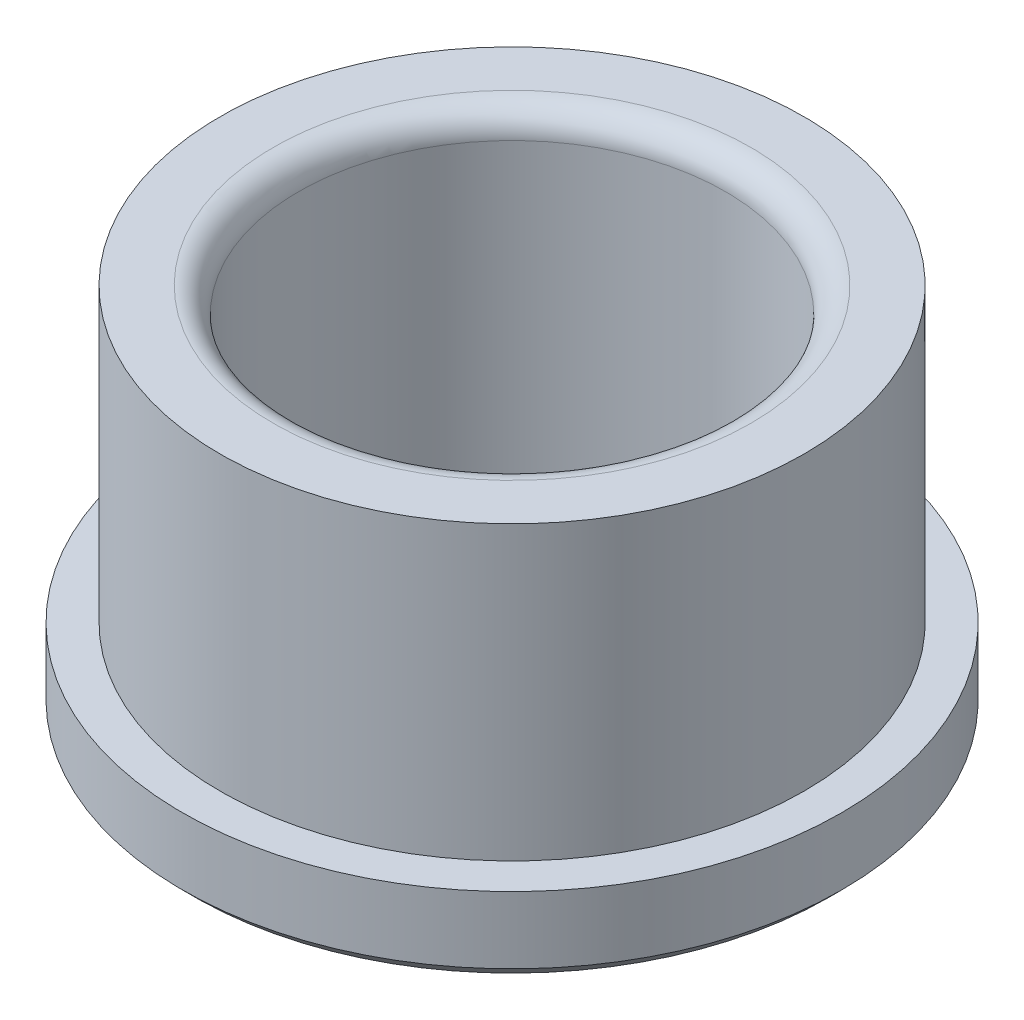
ISO-10303-21;
HEADER;
FILE_DESCRIPTION(('STEP AP214'),'2;1');
FILE_NAME('part.step','',(''),(''),'','','');
FILE_SCHEMA(('AUTOMOTIVE_DESIGN { 1 0 10303 214 1 1 1 1 }'));
ENDSEC;
DATA;
#1=APPLICATION_CONTEXT('core data for automotive mechanical design processes');
#2=APPLICATION_PROTOCOL_DEFINITION('international standard','automotive_design',2000,#1);
#3=PRODUCT_CONTEXT('',#1,'mechanical');
#4=PRODUCT('Part','Part','',(#3));
#5=PRODUCT_RELATED_PRODUCT_CATEGORY('part','',(#4));
#6=PRODUCT_DEFINITION_FORMATION('','',#4);
#7=PRODUCT_DEFINITION_CONTEXT('part definition',#1,'design');
#8=PRODUCT_DEFINITION('design','',#6,#7);
#9=PRODUCT_DEFINITION_SHAPE('','',#8);
#10=(LENGTH_UNIT() NAMED_UNIT(*) SI_UNIT(.MILLI.,.METRE.));
#11=(NAMED_UNIT(*) PLANE_ANGLE_UNIT() SI_UNIT($,.RADIAN.));
#12=(NAMED_UNIT(*) SI_UNIT($,.STERADIAN.) SOLID_ANGLE_UNIT());
#13=UNCERTAINTY_MEASURE_WITH_UNIT(LENGTH_MEASURE(1.E-05),#10,'distance_accuracy_value','');
#14=(GEOMETRIC_REPRESENTATION_CONTEXT(3) GLOBAL_UNCERTAINTY_ASSIGNED_CONTEXT((#13)) GLOBAL_UNIT_ASSIGNED_CONTEXT((#10,
#11,#12)) REPRESENTATION_CONTEXT('',''));
#15=CARTESIAN_POINT('',(0.,0.,0.));
#16=DIRECTION('',(0.,0.,1.));
#17=DIRECTION('',(1.,0.,0.));
#18=AXIS2_PLACEMENT_3D('',#15,#16,#17);
#19=CARTESIAN_POINT('',(3.49148336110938E-12,-1000.,0.));
#20=DIRECTION('',(0.,-1.,0.));
#21=DIRECTION('',(1.,0.,0.));
#22=AXIS2_PLACEMENT_3D('',#19,#20,#21);
#23=CYLINDRICAL_SURFACE('',#22,17.4688499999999);
#24=CARTESIAN_POINT('',(0.,4.7625,0.));
#25=DIRECTION('',(0.,-1.,0.));
#26=DIRECTION('',(1.,0.,0.));
#27=AXIS2_PLACEMENT_3D('',#24,#25,#26);
#28=CIRCLE('',#27,17.46885);
#29=CARTESIAN_POINT('',(17.4688499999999,4.76250000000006,0.));
#30=VERTEX_POINT('',#29);
#31=EDGE_CURVE('E39',#30,#30,#28,.T.);
#32=ORIENTED_EDGE('',*,*,#31,.F.);
#33=EDGE_LOOP('',(#32));
#34=FACE_BOUND('',#33,.T.);
#35=CARTESIAN_POINT('',(0.,22.2249999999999,0.));
#36=DIRECTION('',(0.,-1.,0.));
#37=DIRECTION('',(1.,0.,0.));
#38=AXIS2_PLACEMENT_3D('',#35,#36,#37);
#39=CIRCLE('',#38,17.4688499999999);
#40=CARTESIAN_POINT('',(17.4688499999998,22.225,0.));
#41=VERTEX_POINT('',#40);
#42=EDGE_CURVE('E60',#41,#41,#39,.T.);
#43=ORIENTED_EDGE('',*,*,#42,.T.);
#44=EDGE_LOOP('',(#43));
#45=FACE_BOUND('',#44,.T.);
#46=ADVANCED_FACE('F28',(#34,#45),#23,.T.);
#47=CARTESIAN_POINT('',(-19.7104,4.76249999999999,0.));
#48=DIRECTION('',(0.,-1.,0.));
#49=DIRECTION('',(1.,0.,0.));
#50=AXIS2_PLACEMENT_3D('',#47,#48,#49);
#51=PLANE('',#50);
#52=CARTESIAN_POINT('',(0.,4.7625,0.));
#53=DIRECTION('',(0.,-1.,0.));
#54=DIRECTION('',(1.,0.,0.));
#55=AXIS2_PLACEMENT_3D('',#52,#53,#54);
#56=CIRCLE('',#55,19.7104);
#57=CARTESIAN_POINT('',(19.7104,4.76250000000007,0.));
#58=VERTEX_POINT('',#57);
#59=EDGE_CURVE('E43',#58,#58,#56,.T.);
#60=ORIENTED_EDGE('',*,*,#59,.F.);
#61=EDGE_LOOP('',(#60));
#62=FACE_BOUND('',#61,.T.);
#63=ORIENTED_EDGE('',*,*,#31,.T.);
#64=EDGE_LOOP('',(#63));
#65=FACE_BOUND('',#64,.T.);
#66=ADVANCED_FACE('F77',(#62,#65),#51,.F.);
#67=CARTESIAN_POINT('',(3.49148336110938E-12,-1000.,0.));
#68=DIRECTION('',(0.,-1.,0.));
#69=DIRECTION('',(1.,0.,0.));
#70=AXIS2_PLACEMENT_3D('',#67,#68,#69);
#71=CYLINDRICAL_SURFACE('',#70,19.7104);
#72=CARTESIAN_POINT('',(0.,0.761999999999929,0.));
#73=DIRECTION('',(0.,-1.,0.));
#74=DIRECTION('',(1.,0.,0.));
#75=AXIS2_PLACEMENT_3D('',#72,#73,#74);
#76=CIRCLE('',#75,19.7104);
#77=CARTESIAN_POINT('',(19.7104,0.761999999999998,0.));
#78=VERTEX_POINT('',#77);
#79=EDGE_CURVE('E48',#78,#78,#76,.T.);
#80=ORIENTED_EDGE('',*,*,#79,.F.);
#81=EDGE_LOOP('',(#80));
#82=FACE_BOUND('',#81,.T.);
#83=ORIENTED_EDGE('',*,*,#59,.T.);
#84=EDGE_LOOP('',(#83));
#85=FACE_BOUND('',#84,.T.);
#86=ADVANCED_FACE('F82',(#82,#85),#71,.T.);
#87=CARTESIAN_POINT('',(0.,0.761999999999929,0.));
#88=DIRECTION('',(0.,1.,0.));
#89=DIRECTION('',(-1.,0.,0.));
#90=AXIS2_PLACEMENT_3D('',#87,#88,#89);
#91=CONICAL_SURFACE('',#90,19.7104,0.785398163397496);
#92=CARTESIAN_POINT('',(0.,0.,0.));
#93=DIRECTION('',(0.,-1.,0.));
#94=DIRECTION('',(1.,0.,0.));
#95=AXIS2_PLACEMENT_3D('',#92,#93,#94);
#96=CIRCLE('',#95,18.9484);
#97=CARTESIAN_POINT('',(18.9484,0.,0.));
#98=VERTEX_POINT('',#97);
#99=EDGE_CURVE('E51',#98,#98,#96,.T.);
#100=ORIENTED_EDGE('',*,*,#99,.F.);
#101=EDGE_LOOP('',(#100));
#102=FACE_BOUND('',#101,.T.);
#103=ORIENTED_EDGE('',*,*,#79,.T.);
#104=EDGE_LOOP('',(#103));
#105=FACE_BOUND('',#104,.T.);
#106=ADVANCED_FACE('F89',(#102,#105),#91,.T.);
#107=CARTESIAN_POINT('',(-13.5255,0.,0.));
#108=DIRECTION('',(0.,1.,0.));
#109=DIRECTION('',(-1.,0.,0.));
#110=AXIS2_PLACEMENT_3D('',#107,#108,#109);
#111=PLANE('',#110);
#112=CARTESIAN_POINT('',(0.,0.,0.));
#113=DIRECTION('',(0.,-1.,0.));
#114=DIRECTION('',(1.,0.,0.));
#115=AXIS2_PLACEMENT_3D('',#112,#113,#114);
#116=CIRCLE('',#115,13.5255);
#117=CARTESIAN_POINT('',(13.5255,0.,0.));
#118=VERTEX_POINT('',#117);
#119=EDGE_CURVE('E54',#118,#118,#116,.T.);
#120=ORIENTED_EDGE('',*,*,#119,.F.);
#121=EDGE_LOOP('',(#120));
#122=FACE_BOUND('',#121,.T.);
#123=ORIENTED_EDGE('',*,*,#99,.T.);
#124=EDGE_LOOP('',(#123));
#125=FACE_BOUND('',#124,.T.);
#126=ADVANCED_FACE('F93',(#122,#125),#111,.F.);
#127=CARTESIAN_POINT('',(0.,0.,0.));
#128=DIRECTION('',(0.,-1.,0.));
#129=DIRECTION('',(1.,0.,0.));
#130=AXIS2_PLACEMENT_3D('',#127,#128,#129);
#131=CONICAL_SURFACE('',#130,13.5255,0.785398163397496);
#132=CARTESIAN_POINT('',(0.,0.761999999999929,0.));
#133=DIRECTION('',(0.,-1.,0.));
#134=DIRECTION('',(1.,0.,0.));
#135=AXIS2_PLACEMENT_3D('',#132,#133,#134);
#136=CIRCLE('',#135,12.7635);
#137=CARTESIAN_POINT('',(12.7635,0.761999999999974,0.));
#138=VERTEX_POINT('',#137);
#139=EDGE_CURVE('E57',#138,#138,#136,.T.);
#140=ORIENTED_EDGE('',*,*,#139,.F.);
#141=EDGE_LOOP('',(#140));
#142=FACE_BOUND('',#141,.T.);
#143=ORIENTED_EDGE('',*,*,#119,.T.);
#144=EDGE_LOOP('',(#143));
#145=FACE_BOUND('',#144,.T.);
#146=ADVANCED_FACE('F74',(#142,#145),#131,.F.);
#147=CARTESIAN_POINT('',(3.49148336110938E-12,-1000.,0.));
#148=DIRECTION('',(0.,-1.,0.));
#149=DIRECTION('',(1.,0.,0.));
#150=AXIS2_PLACEMENT_3D('',#147,#148,#149);
#151=CYLINDRICAL_SURFACE('',#150,12.7634999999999);
#152=CARTESIAN_POINT('',(0.,20.7010000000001,0.));
#153=DIRECTION('',(0.,-1.,0.));
#154=DIRECTION('',(1.,0.,0.));
#155=AXIS2_PLACEMENT_3D('',#152,#153,#154);
#156=CIRCLE('',#155,12.7634999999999);
#157=CARTESIAN_POINT('',(12.7634999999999,20.7010000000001,0.));
#158=VERTEX_POINT('',#157);
#159=EDGE_CURVE('E10',#158,#158,#156,.F.);
#160=ORIENTED_EDGE('',*,*,#159,.T.);
#161=EDGE_LOOP('',(#160));
#162=FACE_BOUND('',#161,.T.);
#163=ORIENTED_EDGE('',*,*,#139,.T.);
#164=EDGE_LOOP('',(#163));
#165=FACE_BOUND('',#164,.T.);
#166=ADVANCED_FACE('F67',(#162,#165),#151,.F.);
#167=CARTESIAN_POINT('',(-17.46885,22.225,0.));
#168=DIRECTION('',(0.,-1.,0.));
#169=DIRECTION('',(1.,0.,0.));
#170=AXIS2_PLACEMENT_3D('',#167,#168,#169);
#171=PLANE('',#170);
#172=CARTESIAN_POINT('',(0.,22.2250000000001,0.));
#173=DIRECTION('',(0.,-1.,0.));
#174=DIRECTION('',(1.,0.,0.));
#175=AXIS2_PLACEMENT_3D('',#172,#173,#174);
#176=CIRCLE('',#175,14.2874999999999);
#177=CARTESIAN_POINT('',(14.2874999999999,22.2250000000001,0.));
#178=VERTEX_POINT('',#177);
#179=EDGE_CURVE('E35',#178,#178,#176,.T.);
#180=ORIENTED_EDGE('',*,*,#179,.T.);
#181=EDGE_LOOP('',(#180));
#182=FACE_BOUND('',#181,.T.);
#183=ORIENTED_EDGE('',*,*,#42,.F.);
#184=EDGE_LOOP('',(#183));
#185=FACE_BOUND('',#184,.T.);
#186=ADVANCED_FACE('F65',(#182,#185),#171,.F.);
#187=CARTESIAN_POINT('',(0.,20.7010000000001,0.));
#188=DIRECTION('',(0.,-1.,0.));
#189=DIRECTION('',(1.,0.,0.));
#190=AXIS2_PLACEMENT_3D('',#187,#188,#189);
#191=TOROIDAL_SURFACE('',#190,14.2874999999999,1.524);
#192=ORIENTED_EDGE('',*,*,#159,.F.);
#193=EDGE_LOOP('',(#192));
#194=FACE_BOUND('',#193,.T.);
#195=ORIENTED_EDGE('',*,*,#179,.F.);
#196=EDGE_LOOP('',(#195));
#197=FACE_BOUND('',#196,.T.);
#198=ADVANCED_FACE('F30',(#194,#197),#191,.T.);
#199=CLOSED_SHELL('',(#46,#66,#86,#106,#126,#146,#166,#186,#198));
#200=MANIFOLD_SOLID_BREP('B2',#199);
#201=ADVANCED_BREP_SHAPE_REPRESENTATION('',(#18,#200),#14);
#202=SHAPE_DEFINITION_REPRESENTATION(#9,#201);
ENDSEC;
END-ISO-10303-21;
